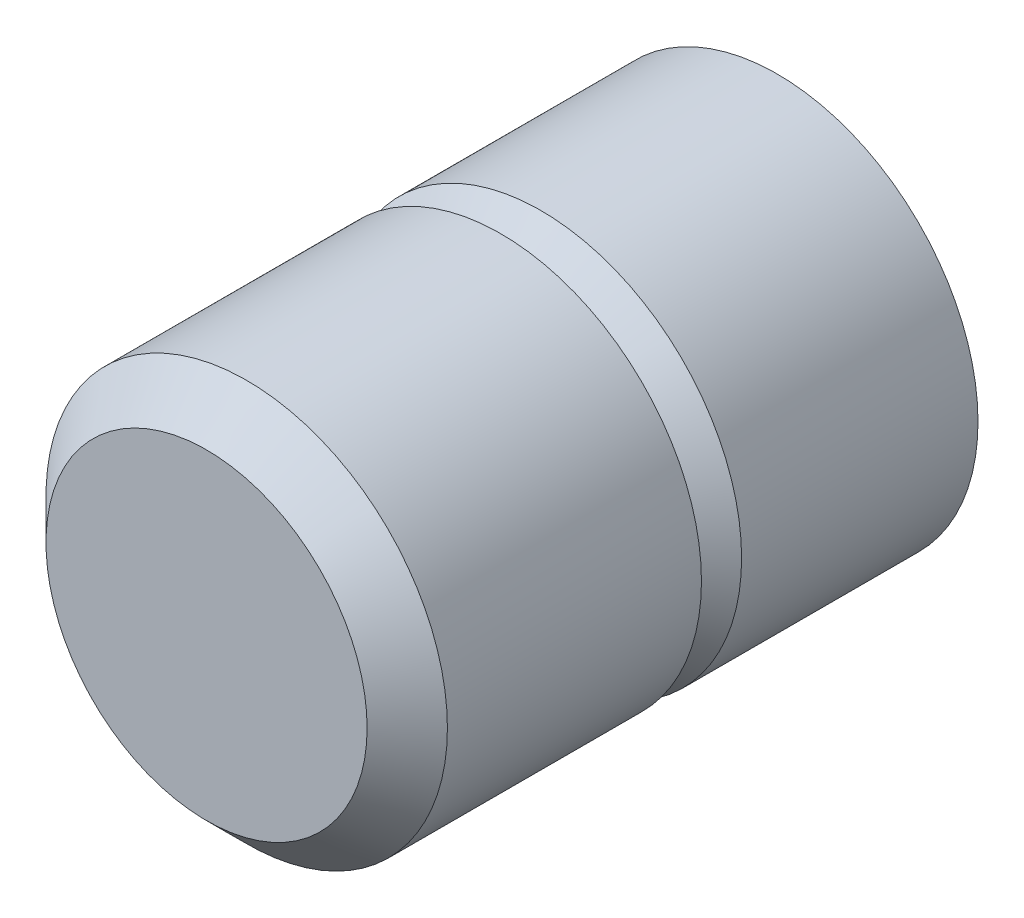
from build123d import *

# Parameters (mm, degrees)
SKETCH2_R       = 53.975
TYPE123_N_DEPTH = 35.924975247


with BuildPart() as part:
    # Sketch1 → Revolve1 (revolve)
    with BuildSketch(Plane(origin=(0, 0, 0), x_dir=(0, 0, -1), z_dir=(1, 0, 0)), mode=Mode.PRIVATE) as revolve1_sk:
        Polygon((0, 0), (0, 6.002528), (1.500632, 7.50316), (10.9982, 7.50316), (10.9982, 6.002528), (12.498832, 7.50316), (21.336, 7.50316), (21.336, 5.715), (22.606, 6.35), (53.34, 6.35), (54.61, 5.08), (54.61, 0), align=None)
    revolve(revolve1_sk.sketch.rotate(Axis((0, 0, 0), (0, 0, -1)), 90), axis=Axis((0, 0, 0), (0, 0, -1)))

    # Sketch2 → Type123-N (cut, through all)
    with BuildSketch(Plane(origin=(0, 0, -21.336), x_dir=(-1, 0, 0), z_dir=(0, 0, -1))):
        Circle(SKETCH2_R)
    extrude(amount=TYPE123_N_DEPTH, mode=Mode.SUBTRACT)


solid = part.part
